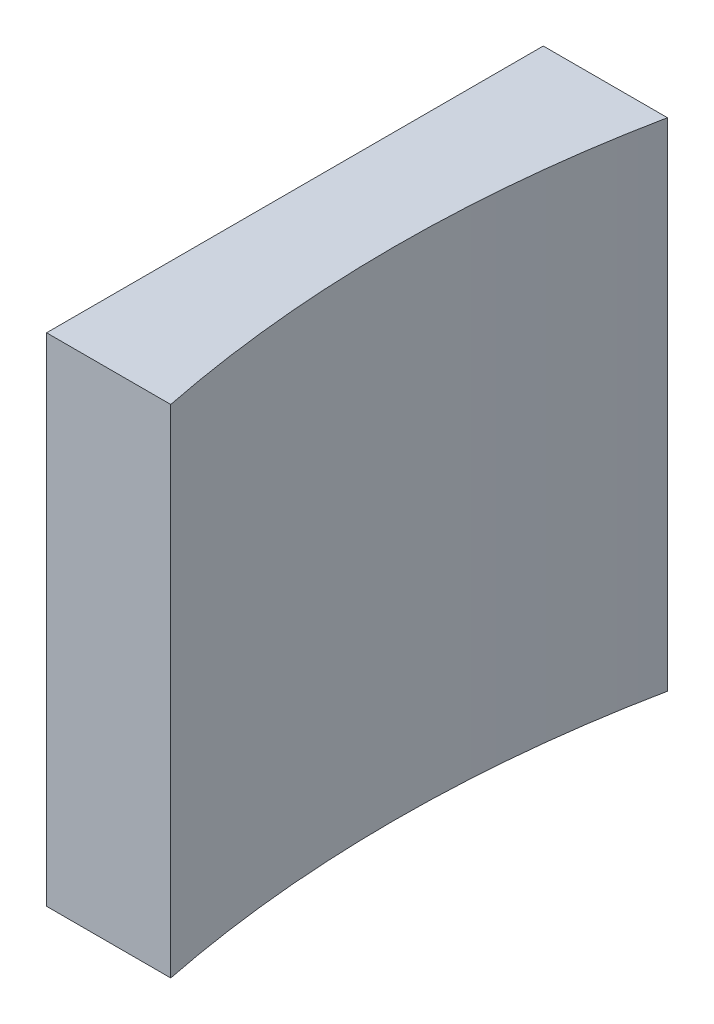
ISO-10303-21;
HEADER;
FILE_DESCRIPTION(('STEP AP214'),'2;1');
FILE_NAME('part.step','',(''),(''),'','','');
FILE_SCHEMA(('AUTOMOTIVE_DESIGN { 1 0 10303 214 1 1 1 1 }'));
ENDSEC;
DATA;
#1=APPLICATION_CONTEXT('core data for automotive mechanical design processes');
#2=APPLICATION_PROTOCOL_DEFINITION('international standard','automotive_design',2000,#1);
#3=PRODUCT_CONTEXT('',#1,'mechanical');
#4=PRODUCT('Part','Part','',(#3));
#5=PRODUCT_RELATED_PRODUCT_CATEGORY('part','',(#4));
#6=PRODUCT_DEFINITION_FORMATION('','',#4);
#7=PRODUCT_DEFINITION_CONTEXT('part definition',#1,'design');
#8=PRODUCT_DEFINITION('design','',#6,#7);
#9=PRODUCT_DEFINITION_SHAPE('','',#8);
#10=(LENGTH_UNIT() NAMED_UNIT(*) SI_UNIT(.MILLI.,.METRE.));
#11=(NAMED_UNIT(*) PLANE_ANGLE_UNIT() SI_UNIT($,.RADIAN.));
#12=(NAMED_UNIT(*) SI_UNIT($,.STERADIAN.) SOLID_ANGLE_UNIT());
#13=UNCERTAINTY_MEASURE_WITH_UNIT(LENGTH_MEASURE(1.E-05),#10,'distance_accuracy_value','');
#14=(GEOMETRIC_REPRESENTATION_CONTEXT(3) GLOBAL_UNCERTAINTY_ASSIGNED_CONTEXT((#13)) GLOBAL_UNIT_ASSIGNED_CONTEXT((#10,
#11,#12)) REPRESENTATION_CONTEXT('',''));
#15=CARTESIAN_POINT('',(0.,0.,0.));
#16=DIRECTION('',(0.,0.,1.));
#17=DIRECTION('',(1.,0.,0.));
#18=AXIS2_PLACEMENT_3D('',#15,#16,#17);
#19=CARTESIAN_POINT('',(-50.,200.,100.));
#20=DIRECTION('',(0.,0.,-1.));
#21=DIRECTION('',(-1.,0.,0.));
#22=AXIS2_PLACEMENT_3D('',#19,#20,#21);
#23=PLANE('',#22);
#24=DIRECTION('',(1.,0.,0.));
#25=VECTOR('',#24,1.);
#26=CARTESIAN_POINT('',(-50.,0.,100.));
#27=LINE('',#26,#25);
#28=CARTESIAN_POINT('',(-50.,0.,100.));
#29=VERTEX_POINT('',#28);
#30=CARTESIAN_POINT('',(0.,0.,99.9999999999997));
#31=VERTEX_POINT('',#30);
#32=EDGE_CURVE('E75',#29,#31,#27,.T.);
#33=ORIENTED_EDGE('',*,*,#32,.T.);
#34=DIRECTION('',(0.,-1.,0.));
#35=VECTOR('',#34,1.);
#36=CARTESIAN_POINT('',(0.,200.,99.9999999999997));
#37=LINE('',#36,#35);
#38=CARTESIAN_POINT('',(0.,200.,99.9999999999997));
#39=VERTEX_POINT('',#38);
#40=EDGE_CURVE('E11',#39,#31,#37,.T.);
#41=ORIENTED_EDGE('',*,*,#40,.F.);
#42=DIRECTION('',(1.,0.,0.));
#43=VECTOR('',#42,1.);
#44=CARTESIAN_POINT('',(-50.,200.,100.));
#45=LINE('',#44,#43);
#46=CARTESIAN_POINT('',(-50.,200.,100.));
#47=VERTEX_POINT('',#46);
#48=EDGE_CURVE('E93',#47,#39,#45,.T.);
#49=ORIENTED_EDGE('',*,*,#48,.F.);
#50=DIRECTION('',(0.,-1.,0.));
#51=VECTOR('',#50,1.);
#52=CARTESIAN_POINT('',(-50.,200.,100.));
#53=LINE('',#52,#51);
#54=EDGE_CURVE('E87',#47,#29,#53,.T.);
#55=ORIENTED_EDGE('',*,*,#54,.T.);
#56=EDGE_LOOP('',(#33,#41,#49,#55));
#57=FACE_BOUND('',#56,.T.);
#58=ADVANCED_FACE('F31',(#57),#23,.F.);
#59=CARTESIAN_POINT('',(495.,200.,0.));
#60=DIRECTION('',(0.,-1.,0.));
#61=DIRECTION('',(0.,0.,-1.));
#62=AXIS2_PLACEMENT_3D('',#59,#60,#61);
#63=CYLINDRICAL_SURFACE('',#62,505.);
#64=CARTESIAN_POINT('',(495.,0.,0.));
#65=DIRECTION('',(0.,-1.,0.));
#66=DIRECTION('',(0.,0.,1.));
#67=AXIS2_PLACEMENT_3D('',#64,#65,#66);
#68=CIRCLE('',#67,505.);
#69=CARTESIAN_POINT('',(0.,0.,-100.));
#70=VERTEX_POINT('',#69);
#71=EDGE_CURVE('E71',#31,#70,#68,.T.);
#72=ORIENTED_EDGE('',*,*,#71,.T.);
#73=DIRECTION('',(0.,-1.,0.));
#74=VECTOR('',#73,1.);
#75=CARTESIAN_POINT('',(0.,200.,-100.));
#76=LINE('',#75,#74);
#77=CARTESIAN_POINT('',(0.,200.,-100.));
#78=VERTEX_POINT('',#77);
#79=EDGE_CURVE('E38',#78,#70,#76,.T.);
#80=ORIENTED_EDGE('',*,*,#79,.F.);
#81=CARTESIAN_POINT('',(495.,200.,0.));
#82=DIRECTION('',(0.,-1.,0.));
#83=DIRECTION('',(0.,0.,1.));
#84=AXIS2_PLACEMENT_3D('',#81,#82,#83);
#85=CIRCLE('',#84,505.);
#86=EDGE_CURVE('E83',#39,#78,#85,.T.);
#87=ORIENTED_EDGE('',*,*,#86,.F.);
#88=ORIENTED_EDGE('',*,*,#40,.T.);
#89=EDGE_LOOP('',(#72,#80,#87,#88));
#90=FACE_BOUND('',#89,.T.);
#91=ADVANCED_FACE('F82',(#90),#63,.F.);
#92=CARTESIAN_POINT('',(-50.,200.,-100.));
#93=DIRECTION('',(0.,0.,1.));
#94=DIRECTION('',(1.,0.,0.));
#95=AXIS2_PLACEMENT_3D('',#92,#93,#94);
#96=PLANE('',#95);
#97=DIRECTION('',(-1.,0.,0.));
#98=VECTOR('',#97,1.);
#99=CARTESIAN_POINT('',(-50.,0.,-100.));
#100=LINE('',#99,#98);
#101=CARTESIAN_POINT('',(-50.,0.,-100.));
#102=VERTEX_POINT('',#101);
#103=EDGE_CURVE('E76',#70,#102,#100,.T.);
#104=ORIENTED_EDGE('',*,*,#103,.T.);
#105=DIRECTION('',(0.,-1.,0.));
#106=VECTOR('',#105,1.);
#107=CARTESIAN_POINT('',(-50.,200.,-100.));
#108=LINE('',#107,#106);
#109=CARTESIAN_POINT('',(-50.,200.,-100.));
#110=VERTEX_POINT('',#109);
#111=EDGE_CURVE('E99',#110,#102,#108,.T.);
#112=ORIENTED_EDGE('',*,*,#111,.F.);
#113=DIRECTION('',(-1.,0.,0.));
#114=VECTOR('',#113,1.);
#115=CARTESIAN_POINT('',(-50.,200.,-100.));
#116=LINE('',#115,#114);
#117=EDGE_CURVE('E50',#78,#110,#116,.T.);
#118=ORIENTED_EDGE('',*,*,#117,.F.);
#119=ORIENTED_EDGE('',*,*,#79,.T.);
#120=EDGE_LOOP('',(#104,#112,#118,#119));
#121=FACE_BOUND('',#120,.T.);
#122=ADVANCED_FACE('F102',(#121),#96,.F.);
#123=CARTESIAN_POINT('',(-50.,200.,-100.));
#124=DIRECTION('',(1.,0.,0.));
#125=DIRECTION('',(0.,0.,-1.));
#126=AXIS2_PLACEMENT_3D('',#123,#124,#125);
#127=PLANE('',#126);
#128=DIRECTION('',(0.,0.,1.));
#129=VECTOR('',#128,1.);
#130=CARTESIAN_POINT('',(-50.,0.,-100.));
#131=LINE('',#130,#129);
#132=EDGE_CURVE('E91',#102,#29,#131,.T.);
#133=ORIENTED_EDGE('',*,*,#132,.T.);
#134=ORIENTED_EDGE('',*,*,#54,.F.);
#135=DIRECTION('',(0.,0.,1.));
#136=VECTOR('',#135,1.);
#137=CARTESIAN_POINT('',(-50.,200.,-100.));
#138=LINE('',#137,#136);
#139=EDGE_CURVE('E45',#110,#47,#138,.T.);
#140=ORIENTED_EDGE('',*,*,#139,.F.);
#141=ORIENTED_EDGE('',*,*,#111,.T.);
#142=EDGE_LOOP('',(#133,#134,#140,#141));
#143=FACE_BOUND('',#142,.T.);
#144=ADVANCED_FACE('F104',(#143),#127,.F.);
#145=CARTESIAN_POINT('',(495.,200.,0.));
#146=DIRECTION('',(0.,1.,0.));
#147=DIRECTION('',(0.,0.,1.));
#148=AXIS2_PLACEMENT_3D('',#145,#146,#147);
#149=PLANE('',#148);
#150=ORIENTED_EDGE('',*,*,#48,.T.);
#151=ORIENTED_EDGE('',*,*,#86,.T.);
#152=ORIENTED_EDGE('',*,*,#117,.T.);
#153=ORIENTED_EDGE('',*,*,#139,.T.);
#154=EDGE_LOOP('',(#150,#151,#152,#153));
#155=FACE_BOUND('',#154,.T.);
#156=ADVANCED_FACE('F105',(#155),#149,.T.);
#157=CARTESIAN_POINT('',(495.,0.,0.));
#158=DIRECTION('',(0.,1.,0.));
#159=DIRECTION('',(0.,0.,1.));
#160=AXIS2_PLACEMENT_3D('',#157,#158,#159);
#161=PLANE('',#160);
#162=ORIENTED_EDGE('',*,*,#32,.F.);
#163=ORIENTED_EDGE('',*,*,#132,.F.);
#164=ORIENTED_EDGE('',*,*,#103,.F.);
#165=ORIENTED_EDGE('',*,*,#71,.F.);
#166=EDGE_LOOP('',(#162,#163,#164,#165));
#167=FACE_BOUND('',#166,.T.);
#168=ADVANCED_FACE('F72',(#167),#161,.F.);
#169=CLOSED_SHELL('',(#58,#91,#122,#144,#156,#168));
#170=MANIFOLD_SOLID_BREP('B2',#169);
#171=ADVANCED_BREP_SHAPE_REPRESENTATION('',(#18,#170),#14);
#172=SHAPE_DEFINITION_REPRESENTATION(#9,#171);
ENDSEC;
END-ISO-10303-21;
